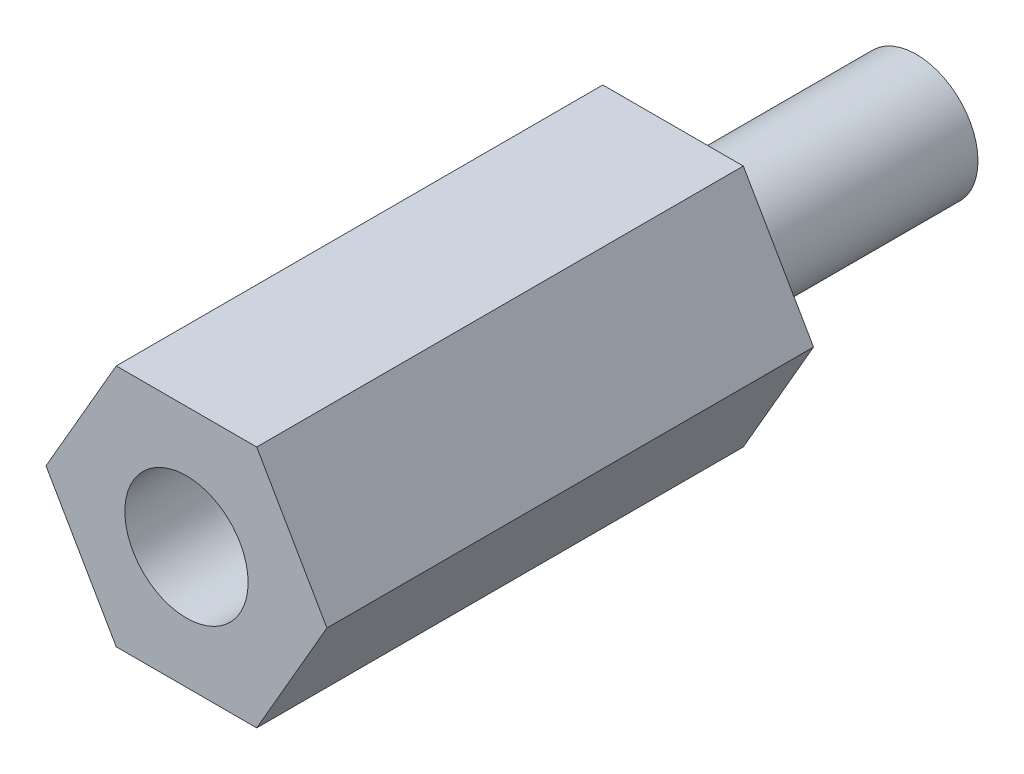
ISO-10303-21;
HEADER;
FILE_DESCRIPTION(('STEP AP214'),'2;1');
FILE_NAME('part.step','',(''),(''),'','','');
FILE_SCHEMA(('AUTOMOTIVE_DESIGN { 1 0 10303 214 1 1 1 1 }'));
ENDSEC;
DATA;
#1=APPLICATION_CONTEXT('core data for automotive mechanical design processes');
#2=APPLICATION_PROTOCOL_DEFINITION('international standard','automotive_design',2000,#1);
#3=PRODUCT_CONTEXT('',#1,'mechanical');
#4=PRODUCT('Part','Part','',(#3));
#5=PRODUCT_RELATED_PRODUCT_CATEGORY('part','',(#4));
#6=PRODUCT_DEFINITION_FORMATION('','',#4);
#7=PRODUCT_DEFINITION_CONTEXT('part definition',#1,'design');
#8=PRODUCT_DEFINITION('design','',#6,#7);
#9=PRODUCT_DEFINITION_SHAPE('','',#8);
#10=(LENGTH_UNIT() NAMED_UNIT(*) SI_UNIT(.MILLI.,.METRE.));
#11=(NAMED_UNIT(*) PLANE_ANGLE_UNIT() SI_UNIT($,.RADIAN.));
#12=(NAMED_UNIT(*) SI_UNIT($,.STERADIAN.) SOLID_ANGLE_UNIT());
#13=UNCERTAINTY_MEASURE_WITH_UNIT(LENGTH_MEASURE(1.E-05),#10,'distance_accuracy_value','');
#14=(GEOMETRIC_REPRESENTATION_CONTEXT(3) GLOBAL_UNCERTAINTY_ASSIGNED_CONTEXT((#13)) GLOBAL_UNIT_ASSIGNED_CONTEXT((#10,
#11,#12)) REPRESENTATION_CONTEXT('',''));
#15=CARTESIAN_POINT('',(0.,0.,0.));
#16=DIRECTION('',(0.,0.,1.));
#17=DIRECTION('',(1.,0.,0.));
#18=AXIS2_PLACEMENT_3D('',#15,#16,#17);
#19=CARTESIAN_POINT('',(-5.49926131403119,0.,19.05));
#20=DIRECTION('',(0.866025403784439,0.5,0.));
#21=DIRECTION('',(-0.5,0.866025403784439,0.));
#22=AXIS2_PLACEMENT_3D('',#19,#20,#21);
#23=PLANE('',#22);
#24=DIRECTION('',(0.5,-0.866025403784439,0.));
#25=VECTOR('',#24,1.);
#26=CARTESIAN_POINT('',(-5.49926131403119,0.,0.));
#27=LINE('',#26,#25);
#28=CARTESIAN_POINT('',(-5.49926131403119,0.,0.));
#29=VERTEX_POINT('',#28);
#30=CARTESIAN_POINT('',(-2.7496306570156,-4.7625,0.));
#31=VERTEX_POINT('',#30);
#32=EDGE_CURVE('E141',#29,#31,#27,.T.);
#33=ORIENTED_EDGE('',*,*,#32,.T.);
#34=DIRECTION('',(0.,0.,-1.));
#35=VECTOR('',#34,1.);
#36=CARTESIAN_POINT('',(-2.7496306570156,-4.7625,19.05));
#37=LINE('',#36,#35);
#38=CARTESIAN_POINT('',(-2.7496306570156,-4.7625,19.05));
#39=VERTEX_POINT('',#38);
#40=EDGE_CURVE('E47',#39,#31,#37,.T.);
#41=ORIENTED_EDGE('',*,*,#40,.F.);
#42=DIRECTION('',(0.5,-0.866025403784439,0.));
#43=VECTOR('',#42,1.);
#44=CARTESIAN_POINT('',(-5.49926131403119,0.,19.05));
#45=LINE('',#44,#43);
#46=CARTESIAN_POINT('',(-5.49926131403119,0.,19.05));
#47=VERTEX_POINT('',#46);
#48=EDGE_CURVE('E157',#47,#39,#45,.T.);
#49=ORIENTED_EDGE('',*,*,#48,.F.);
#50=DIRECTION('',(0.,0.,-1.));
#51=VECTOR('',#50,1.);
#52=CARTESIAN_POINT('',(-5.49926131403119,0.,19.05));
#53=LINE('',#52,#51);
#54=EDGE_CURVE('E137',#47,#29,#53,.T.);
#55=ORIENTED_EDGE('',*,*,#54,.T.);
#56=EDGE_LOOP('',(#33,#41,#49,#55));
#57=FACE_BOUND('',#56,.T.);
#58=ADVANCED_FACE('F38',(#57),#23,.F.);
#59=CARTESIAN_POINT('',(-2.7496306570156,-4.7625,19.05));
#60=DIRECTION('',(0.,1.,0.));
#61=DIRECTION('',(-1.,0.,0.));
#62=AXIS2_PLACEMENT_3D('',#59,#60,#61);
#63=PLANE('',#62);
#64=DIRECTION('',(1.,0.,0.));
#65=VECTOR('',#64,1.);
#66=CARTESIAN_POINT('',(-2.7496306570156,-4.7625,0.));
#67=LINE('',#66,#65);
#68=CARTESIAN_POINT('',(2.74963065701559,-4.7625,0.));
#69=VERTEX_POINT('',#68);
#70=EDGE_CURVE('E145',#31,#69,#67,.T.);
#71=ORIENTED_EDGE('',*,*,#70,.T.);
#72=DIRECTION('',(0.,0.,-1.));
#73=VECTOR('',#72,1.);
#74=CARTESIAN_POINT('',(2.74963065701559,-4.7625,19.05));
#75=LINE('',#74,#73);
#76=CARTESIAN_POINT('',(2.74963065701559,-4.7625,19.05));
#77=VERTEX_POINT('',#76);
#78=EDGE_CURVE('E164',#77,#69,#75,.T.);
#79=ORIENTED_EDGE('',*,*,#78,.F.);
#80=DIRECTION('',(1.,0.,0.));
#81=VECTOR('',#80,1.);
#82=CARTESIAN_POINT('',(-2.7496306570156,-4.7625,19.05));
#83=LINE('',#82,#81);
#84=EDGE_CURVE('E105',#39,#77,#83,.T.);
#85=ORIENTED_EDGE('',*,*,#84,.F.);
#86=ORIENTED_EDGE('',*,*,#40,.T.);
#87=EDGE_LOOP('',(#71,#79,#85,#86));
#88=FACE_BOUND('',#87,.T.);
#89=ADVANCED_FACE('F170',(#88),#63,.F.);
#90=CARTESIAN_POINT('',(2.74963065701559,-4.7625,19.05));
#91=DIRECTION('',(-0.866025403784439,0.5,0.));
#92=DIRECTION('',(-0.5,-0.866025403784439,0.));
#93=AXIS2_PLACEMENT_3D('',#90,#91,#92);
#94=PLANE('',#93);
#95=DIRECTION('',(0.5,0.866025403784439,0.));
#96=VECTOR('',#95,1.);
#97=CARTESIAN_POINT('',(2.74963065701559,-4.7625,0.));
#98=LINE('',#97,#96);
#99=CARTESIAN_POINT('',(5.49926131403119,0.,0.));
#100=VERTEX_POINT('',#99);
#101=EDGE_CURVE('E148',#69,#100,#98,.T.);
#102=ORIENTED_EDGE('',*,*,#101,.T.);
#103=DIRECTION('',(0.,0.,-1.));
#104=VECTOR('',#103,1.);
#105=CARTESIAN_POINT('',(5.49926131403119,0.,19.05));
#106=LINE('',#105,#104);
#107=CARTESIAN_POINT('',(5.49926131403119,0.,19.05));
#108=VERTEX_POINT('',#107);
#109=EDGE_CURVE('E129',#108,#100,#106,.T.);
#110=ORIENTED_EDGE('',*,*,#109,.F.);
#111=DIRECTION('',(0.5,0.866025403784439,0.));
#112=VECTOR('',#111,1.);
#113=CARTESIAN_POINT('',(2.74963065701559,-4.7625,19.05));
#114=LINE('',#113,#112);
#115=EDGE_CURVE('E118',#77,#108,#114,.T.);
#116=ORIENTED_EDGE('',*,*,#115,.F.);
#117=ORIENTED_EDGE('',*,*,#78,.T.);
#118=EDGE_LOOP('',(#102,#110,#116,#117));
#119=FACE_BOUND('',#118,.T.);
#120=ADVANCED_FACE('F178',(#119),#94,.F.);
#121=CARTESIAN_POINT('',(5.49926131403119,0.,19.05));
#122=DIRECTION('',(-0.866025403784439,-0.5,0.));
#123=DIRECTION('',(0.5,-0.866025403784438,0.));
#124=AXIS2_PLACEMENT_3D('',#121,#122,#123);
#125=PLANE('',#124);
#126=DIRECTION('',(-0.5,0.866025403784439,0.));
#127=VECTOR('',#126,1.);
#128=CARTESIAN_POINT('',(5.49926131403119,0.,0.));
#129=LINE('',#128,#127);
#130=CARTESIAN_POINT('',(2.74963065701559,4.7625,0.));
#131=VERTEX_POINT('',#130);
#132=EDGE_CURVE('E127',#100,#131,#129,.T.);
#133=ORIENTED_EDGE('',*,*,#132,.T.);
#134=DIRECTION('',(0.,0.,-1.));
#135=VECTOR('',#134,1.);
#136=CARTESIAN_POINT('',(2.74963065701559,4.7625,19.05));
#137=LINE('',#136,#135);
#138=CARTESIAN_POINT('',(2.74963065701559,4.7625,19.05));
#139=VERTEX_POINT('',#138);
#140=EDGE_CURVE('E124',#139,#131,#137,.T.);
#141=ORIENTED_EDGE('',*,*,#140,.F.);
#142=DIRECTION('',(-0.5,0.866025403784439,0.));
#143=VECTOR('',#142,1.);
#144=CARTESIAN_POINT('',(5.49926131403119,0.,19.05));
#145=LINE('',#144,#143);
#146=EDGE_CURVE('E112',#108,#139,#145,.T.);
#147=ORIENTED_EDGE('',*,*,#146,.F.);
#148=ORIENTED_EDGE('',*,*,#109,.T.);
#149=EDGE_LOOP('',(#133,#141,#147,#148));
#150=FACE_BOUND('',#149,.T.);
#151=ADVANCED_FACE('F125',(#150),#125,.F.);
#152=CARTESIAN_POINT('',(2.74963065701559,4.7625,19.05));
#153=DIRECTION('',(0.,-1.,0.));
#154=DIRECTION('',(1.,0.,0.));
#155=AXIS2_PLACEMENT_3D('',#152,#153,#154);
#156=PLANE('',#155);
#157=DIRECTION('',(-1.,0.,0.));
#158=VECTOR('',#157,1.);
#159=CARTESIAN_POINT('',(2.74963065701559,4.7625,0.));
#160=LINE('',#159,#158);
#161=CARTESIAN_POINT('',(-2.74963065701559,4.76250000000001,0.));
#162=VERTEX_POINT('',#161);
#163=EDGE_CURVE('E88',#131,#162,#160,.T.);
#164=ORIENTED_EDGE('',*,*,#163,.T.);
#165=DIRECTION('',(0.,0.,-1.));
#166=VECTOR('',#165,1.);
#167=CARTESIAN_POINT('',(-2.74963065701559,4.76250000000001,19.05));
#168=LINE('',#167,#166);
#169=CARTESIAN_POINT('',(-2.74963065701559,4.76250000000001,19.05));
#170=VERTEX_POINT('',#169);
#171=EDGE_CURVE('E130',#170,#162,#168,.T.);
#172=ORIENTED_EDGE('',*,*,#171,.F.);
#173=DIRECTION('',(-1.,0.,0.));
#174=VECTOR('',#173,1.);
#175=CARTESIAN_POINT('',(2.74963065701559,4.7625,19.05));
#176=LINE('',#175,#174);
#177=EDGE_CURVE('E116',#139,#170,#176,.T.);
#178=ORIENTED_EDGE('',*,*,#177,.F.);
#179=ORIENTED_EDGE('',*,*,#140,.T.);
#180=EDGE_LOOP('',(#164,#172,#178,#179));
#181=FACE_BOUND('',#180,.T.);
#182=ADVANCED_FACE('F132',(#181),#156,.F.);
#183=CARTESIAN_POINT('',(-2.74963065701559,4.76250000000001,19.05));
#184=DIRECTION('',(0.866025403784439,-0.5,0.));
#185=DIRECTION('',(0.5,0.866025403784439,0.));
#186=AXIS2_PLACEMENT_3D('',#183,#184,#185);
#187=PLANE('',#186);
#188=DIRECTION('',(-0.5,-0.866025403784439,0.));
#189=VECTOR('',#188,1.);
#190=CARTESIAN_POINT('',(-2.74963065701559,4.76250000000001,0.));
#191=LINE('',#190,#189);
#192=EDGE_CURVE('E94',#162,#29,#191,.T.);
#193=ORIENTED_EDGE('',*,*,#192,.T.);
#194=ORIENTED_EDGE('',*,*,#54,.F.);
#195=DIRECTION('',(-0.5,-0.866025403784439,0.));
#196=VECTOR('',#195,1.);
#197=CARTESIAN_POINT('',(-2.74963065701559,4.76250000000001,19.05));
#198=LINE('',#197,#196);
#199=EDGE_CURVE('E58',#170,#47,#198,.T.);
#200=ORIENTED_EDGE('',*,*,#199,.F.);
#201=ORIENTED_EDGE('',*,*,#171,.T.);
#202=EDGE_LOOP('',(#193,#194,#200,#201));
#203=FACE_BOUND('',#202,.T.);
#204=ADVANCED_FACE('F206',(#203),#187,.F.);
#205=CARTESIAN_POINT('',(0.,0.,19.05));
#206=DIRECTION('',(0.,0.,1.));
#207=DIRECTION('',(1.,0.,0.));
#208=AXIS2_PLACEMENT_3D('',#205,#206,#207);
#209=PLANE('',#208);
#210=CARTESIAN_POINT('',(0.,0.,19.05));
#211=DIRECTION('',(0.,0.,1.));
#212=DIRECTION('',(1.,0.,0.));
#213=AXIS2_PLACEMENT_3D('',#210,#211,#212);
#214=CIRCLE('',#213,2.413);
#215=CARTESIAN_POINT('',(2.413,0.,19.05));
#216=VERTEX_POINT('',#215);
#217=EDGE_CURVE('E189',#216,#216,#214,.T.);
#218=ORIENTED_EDGE('',*,*,#217,.F.);
#219=EDGE_LOOP('',(#218));
#220=FACE_BOUND('',#219,.T.);
#221=ORIENTED_EDGE('',*,*,#48,.T.);
#222=ORIENTED_EDGE('',*,*,#84,.T.);
#223=ORIENTED_EDGE('',*,*,#115,.T.);
#224=ORIENTED_EDGE('',*,*,#146,.T.);
#225=ORIENTED_EDGE('',*,*,#177,.T.);
#226=ORIENTED_EDGE('',*,*,#199,.T.);
#227=EDGE_LOOP('',(#221,#222,#223,#224,#225,#226));
#228=FACE_BOUND('',#227,.T.);
#229=ADVANCED_FACE('F114',(#220,#228),#209,.T.);
#230=CARTESIAN_POINT('',(0.,0.,0.));
#231=DIRECTION('',(0.,0.,1.));
#232=DIRECTION('',(1.,0.,0.));
#233=AXIS2_PLACEMENT_3D('',#230,#231,#232);
#234=PLANE('',#233);
#235=CARTESIAN_POINT('',(0.,0.,0.));
#236=DIRECTION('',(0.,0.,1.));
#237=DIRECTION('',(1.,0.,0.));
#238=AXIS2_PLACEMENT_3D('',#235,#236,#237);
#239=CIRCLE('',#238,2.413);
#240=CARTESIAN_POINT('',(2.413,0.,0.));
#241=VERTEX_POINT('',#240);
#242=EDGE_CURVE('E11',#241,#241,#239,.F.);
#243=ORIENTED_EDGE('',*,*,#242,.F.);
#244=EDGE_LOOP('',(#243));
#245=FACE_BOUND('',#244,.T.);
#246=ORIENTED_EDGE('',*,*,#32,.F.);
#247=ORIENTED_EDGE('',*,*,#192,.F.);
#248=ORIENTED_EDGE('',*,*,#163,.F.);
#249=ORIENTED_EDGE('',*,*,#132,.F.);
#250=ORIENTED_EDGE('',*,*,#101,.F.);
#251=ORIENTED_EDGE('',*,*,#70,.F.);
#252=EDGE_LOOP('',(#246,#247,#248,#249,#250,#251));
#253=FACE_BOUND('',#252,.T.);
#254=ADVANCED_FACE('F175',(#245,#253),#234,.F.);
#255=CARTESIAN_POINT('',(0.,0.,-9.525));
#256=DIRECTION('',(0.,0.,1.));
#257=DIRECTION('',(1.,0.,0.));
#258=AXIS2_PLACEMENT_3D('',#255,#256,#257);
#259=CYLINDRICAL_SURFACE('',#258,2.413);
#260=CARTESIAN_POINT('',(0.,0.,-9.525));
#261=DIRECTION('',(0.,0.,-1.));
#262=DIRECTION('',(-1.,0.,0.));
#263=AXIS2_PLACEMENT_3D('',#260,#261,#262);
#264=CIRCLE('',#263,2.413);
#265=CARTESIAN_POINT('',(2.413,0.,-9.525));
#266=VERTEX_POINT('',#265);
#267=EDGE_CURVE('E146',#266,#266,#264,.T.);
#268=CARTESIAN_POINT('',(2.413,0.,-9.525));
#269=CARTESIAN_POINT('',(2.413,0.,-9.42578125));
#270=CARTESIAN_POINT('',(2.413,0.,-9.3265625));
#271=CARTESIAN_POINT('',(2.413,0.,-9.128125));
#272=CARTESIAN_POINT('',(2.413,0.,-9.02890625));
#273=CARTESIAN_POINT('',(2.413,0.,-8.83046875));
#274=CARTESIAN_POINT('',(2.413,0.,-8.73125));
#275=CARTESIAN_POINT('',(2.413,0.,-8.5328125));
#276=CARTESIAN_POINT('',(2.413,0.,-8.43359375));
#277=CARTESIAN_POINT('',(2.413,0.,-8.23515625));
#278=CARTESIAN_POINT('',(2.413,0.,-8.1359375));
#279=CARTESIAN_POINT('',(2.413,0.,-7.9375));
#280=CARTESIAN_POINT('',(2.413,0.,-7.83828125));
#281=CARTESIAN_POINT('',(2.413,0.,-7.63984375));
#282=CARTESIAN_POINT('',(2.413,0.,-7.540625));
#283=CARTESIAN_POINT('',(2.413,0.,-7.3421875));
#284=CARTESIAN_POINT('',(2.413,0.,-7.24296875));
#285=CARTESIAN_POINT('',(2.413,0.,-7.04453125));
#286=CARTESIAN_POINT('',(2.413,0.,-6.9453125));
#287=CARTESIAN_POINT('',(2.413,0.,-6.746875));
#288=CARTESIAN_POINT('',(2.413,0.,-6.64765625));
#289=CARTESIAN_POINT('',(2.413,0.,-6.44921875));
#290=CARTESIAN_POINT('',(2.413,0.,-6.35));
#291=CARTESIAN_POINT('',(2.413,0.,-6.1515625));
#292=CARTESIAN_POINT('',(2.413,0.,-6.05234375));
#293=CARTESIAN_POINT('',(2.413,0.,-5.85390625));
#294=CARTESIAN_POINT('',(2.413,0.,-5.7546875));
#295=CARTESIAN_POINT('',(2.413,0.,-5.55625));
#296=CARTESIAN_POINT('',(2.413,0.,-5.45703125));
#297=CARTESIAN_POINT('',(2.413,0.,-5.25859375));
#298=CARTESIAN_POINT('',(2.413,0.,-5.159375));
#299=CARTESIAN_POINT('',(2.413,0.,-4.9609375));
#300=CARTESIAN_POINT('',(2.413,0.,-4.86171875));
#301=CARTESIAN_POINT('',(2.413,0.,-4.66328125));
#302=CARTESIAN_POINT('',(2.413,0.,-4.5640625));
#303=CARTESIAN_POINT('',(2.413,0.,-4.365625));
#304=CARTESIAN_POINT('',(2.413,0.,-4.26640625));
#305=CARTESIAN_POINT('',(2.413,0.,-4.06796875));
#306=CARTESIAN_POINT('',(2.413,0.,-3.96875));
#307=CARTESIAN_POINT('',(2.413,0.,-3.7703125));
#308=CARTESIAN_POINT('',(2.413,0.,-3.67109375));
#309=CARTESIAN_POINT('',(2.413,0.,-3.47265625));
#310=CARTESIAN_POINT('',(2.413,0.,-3.3734375));
#311=CARTESIAN_POINT('',(2.413,0.,-3.175));
#312=CARTESIAN_POINT('',(2.413,0.,-3.07578125));
#313=CARTESIAN_POINT('',(2.413,0.,-2.87734375));
#314=CARTESIAN_POINT('',(2.413,0.,-2.778125));
#315=CARTESIAN_POINT('',(2.413,0.,-2.5796875));
#316=CARTESIAN_POINT('',(2.413,0.,-2.48046875));
#317=CARTESIAN_POINT('',(2.413,0.,-2.28203125));
#318=CARTESIAN_POINT('',(2.413,0.,-2.1828125));
#319=CARTESIAN_POINT('',(2.413,0.,-1.984375));
#320=CARTESIAN_POINT('',(2.413,0.,-1.88515625));
#321=CARTESIAN_POINT('',(2.413,0.,-1.68671875));
#322=CARTESIAN_POINT('',(2.413,0.,-1.5875));
#323=CARTESIAN_POINT('',(2.413,0.,-1.3890625));
#324=CARTESIAN_POINT('',(2.413,0.,-1.28984375));
#325=CARTESIAN_POINT('',(2.413,0.,-1.09140625));
#326=CARTESIAN_POINT('',(2.413,0.,-0.992187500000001));
#327=CARTESIAN_POINT('',(2.413,0.,-0.793750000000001));
#328=CARTESIAN_POINT('',(2.413,0.,-0.69453125));
#329=CARTESIAN_POINT('',(2.413,0.,-0.49609375));
#330=CARTESIAN_POINT('',(2.413,0.,-0.396875));
#331=CARTESIAN_POINT('',(2.413,0.,-0.1984375));
#332=CARTESIAN_POINT('',(2.413,0.,-0.0992187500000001));
#333=CARTESIAN_POINT('',(2.413,0.,0.));
#334=B_SPLINE_CURVE_WITH_KNOTS('',3,(#268,#269,#270,#271,#272,#273,#274,#275,#276,#277,#278,
#279,#280,#281,#282,#283,#284,#285,#286,#287,#288,#289,#290,#291,#292,#293,#294,#295,#296,#297,
#298,#299,#300,#301,#302,#303,#304,#305,#306,#307,#308,#309,#310,#311,#312,#313,#314,#315,#316,
#317,#318,#319,#320,#321,#322,#323,#324,#325,#326,#327,#328,#329,#330,#331,#332,#333),
.UNSPECIFIED.,.F.,.F.,(4,2,2,2,2,2,2,2,2,2,2,2,2,2,2,2,2,2,2,2,2,2,2,2,2,2,2,2,2,2,2,2,4),(0.,
0.29765625,0.5953125,0.892968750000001,1.190625,1.48828125,1.7859375,2.08359375,2.38125,
2.67890625,2.9765625,3.27421875,3.571875,3.86953125,4.1671875,4.46484375,4.7625,5.06015625,
5.3578125,5.65546875,5.953125,6.25078125,6.5484375,6.84609375,7.14375,7.44140625,7.7390625,
8.03671875,8.334375,8.63203125,8.9296875,9.22734375,9.525),.UNSPECIFIED.);
#335=EDGE_CURVE('BSEAM212',#266,#241,#334,.T.);
#336=ORIENTED_EDGE('',*,*,#267,.F.);
#337=ORIENTED_EDGE('',*,*,#242,.T.);
#338=ORIENTED_EDGE('',*,*,#335,.T.);
#339=ORIENTED_EDGE('',*,*,#335,.F.);
#340=EDGE_LOOP('',(#336,#338,#337,#339));
#341=FACE_BOUND('',#340,.T.);
#342=ADVANCED_FACE('F212',(#341),#259,.T.);
#343=CARTESIAN_POINT('',(0.,0.,-9.525));
#344=DIRECTION('',(0.,0.,-1.));
#345=DIRECTION('',(-1.,0.,0.));
#346=AXIS2_PLACEMENT_3D('',#343,#344,#345);
#347=PLANE('',#346);
#348=ORIENTED_EDGE('',*,*,#267,.T.);
#349=EDGE_LOOP('',(#348));
#350=FACE_BOUND('',#349,.T.);
#351=ADVANCED_FACE('F201',(#350),#347,.T.);
#352=CARTESIAN_POINT('',(0.,0.,9.525));
#353=DIRECTION('',(0.,0.,1.));
#354=DIRECTION('',(1.,0.,0.));
#355=AXIS2_PLACEMENT_3D('',#352,#353,#354);
#356=CYLINDRICAL_SURFACE('',#355,2.413);
#357=CARTESIAN_POINT('',(0.,0.,9.525));
#358=DIRECTION('',(0.,0.,1.));
#359=DIRECTION('',(1.,0.,0.));
#360=AXIS2_PLACEMENT_3D('',#357,#358,#359);
#361=CIRCLE('',#360,2.413);
#362=CARTESIAN_POINT('',(2.413,0.,9.525));
#363=VERTEX_POINT('',#362);
#364=EDGE_CURVE('E188',#363,#363,#361,.T.);
#365=CARTESIAN_POINT('',(2.413,0.,9.525));
#366=CARTESIAN_POINT('',(2.413,0.,9.62421875));
#367=CARTESIAN_POINT('',(2.413,0.,9.7234375));
#368=CARTESIAN_POINT('',(2.413,0.,9.921875));
#369=CARTESIAN_POINT('',(2.413,0.,10.02109375));
#370=CARTESIAN_POINT('',(2.413,0.,10.21953125));
#371=CARTESIAN_POINT('',(2.413,0.,10.31875));
#372=CARTESIAN_POINT('',(2.413,0.,10.5171875));
#373=CARTESIAN_POINT('',(2.413,0.,10.61640625));
#374=CARTESIAN_POINT('',(2.413,0.,10.81484375));
#375=CARTESIAN_POINT('',(2.413,0.,10.9140625));
#376=CARTESIAN_POINT('',(2.413,0.,11.1125));
#377=CARTESIAN_POINT('',(2.413,0.,11.21171875));
#378=CARTESIAN_POINT('',(2.413,0.,11.41015625));
#379=CARTESIAN_POINT('',(2.413,0.,11.509375));
#380=CARTESIAN_POINT('',(2.413,0.,11.7078125));
#381=CARTESIAN_POINT('',(2.413,0.,11.80703125));
#382=CARTESIAN_POINT('',(2.413,0.,12.00546875));
#383=CARTESIAN_POINT('',(2.413,0.,12.1046875));
#384=CARTESIAN_POINT('',(2.413,0.,12.303125));
#385=CARTESIAN_POINT('',(2.413,0.,12.40234375));
#386=CARTESIAN_POINT('',(2.413,0.,12.60078125));
#387=CARTESIAN_POINT('',(2.413,0.,12.7));
#388=CARTESIAN_POINT('',(2.413,0.,12.8984375));
#389=CARTESIAN_POINT('',(2.413,0.,12.99765625));
#390=CARTESIAN_POINT('',(2.413,0.,13.19609375));
#391=CARTESIAN_POINT('',(2.413,0.,13.2953125));
#392=CARTESIAN_POINT('',(2.413,0.,13.49375));
#393=CARTESIAN_POINT('',(2.413,0.,13.59296875));
#394=CARTESIAN_POINT('',(2.413,0.,13.79140625));
#395=CARTESIAN_POINT('',(2.413,0.,13.890625));
#396=CARTESIAN_POINT('',(2.413,0.,14.0890625));
#397=CARTESIAN_POINT('',(2.413,0.,14.18828125));
#398=CARTESIAN_POINT('',(2.413,0.,14.38671875));
#399=CARTESIAN_POINT('',(2.413,0.,14.4859375));
#400=CARTESIAN_POINT('',(2.413,0.,14.684375));
#401=CARTESIAN_POINT('',(2.413,0.,14.78359375));
#402=CARTESIAN_POINT('',(2.413,0.,14.98203125));
#403=CARTESIAN_POINT('',(2.413,0.,15.08125));
#404=CARTESIAN_POINT('',(2.413,0.,15.2796875));
#405=CARTESIAN_POINT('',(2.413,0.,15.37890625));
#406=CARTESIAN_POINT('',(2.413,0.,15.57734375));
#407=CARTESIAN_POINT('',(2.413,0.,15.6765625));
#408=CARTESIAN_POINT('',(2.413,0.,15.875));
#409=CARTESIAN_POINT('',(2.413,0.,15.97421875));
#410=CARTESIAN_POINT('',(2.413,0.,16.17265625));
#411=CARTESIAN_POINT('',(2.413,0.,16.271875));
#412=CARTESIAN_POINT('',(2.413,0.,16.4703125));
#413=CARTESIAN_POINT('',(2.413,0.,16.56953125));
#414=CARTESIAN_POINT('',(2.413,0.,16.76796875));
#415=CARTESIAN_POINT('',(2.413,0.,16.8671875));
#416=CARTESIAN_POINT('',(2.413,0.,17.065625));
#417=CARTESIAN_POINT('',(2.413,0.,17.16484375));
#418=CARTESIAN_POINT('',(2.413,0.,17.36328125));
#419=CARTESIAN_POINT('',(2.413,0.,17.4625));
#420=CARTESIAN_POINT('',(2.413,0.,17.6609375));
#421=CARTESIAN_POINT('',(2.413,0.,17.76015625));
#422=CARTESIAN_POINT('',(2.413,0.,17.95859375));
#423=CARTESIAN_POINT('',(2.413,0.,18.0578125));
#424=CARTESIAN_POINT('',(2.413,0.,18.25625));
#425=CARTESIAN_POINT('',(2.413,0.,18.35546875));
#426=CARTESIAN_POINT('',(2.413,0.,18.55390625));
#427=CARTESIAN_POINT('',(2.413,0.,18.653125));
#428=CARTESIAN_POINT('',(2.413,0.,18.8515625));
#429=CARTESIAN_POINT('',(2.413,0.,18.95078125));
#430=CARTESIAN_POINT('',(2.413,0.,19.05));
#431=B_SPLINE_CURVE_WITH_KNOTS('',3,(#365,#366,#367,#368,#369,#370,#371,#372,#373,#374,#375,
#376,#377,#378,#379,#380,#381,#382,#383,#384,#385,#386,#387,#388,#389,#390,#391,#392,#393,#394,
#395,#396,#397,#398,#399,#400,#401,#402,#403,#404,#405,#406,#407,#408,#409,#410,#411,#412,#413,
#414,#415,#416,#417,#418,#419,#420,#421,#422,#423,#424,#425,#426,#427,#428,#429,#430),
.UNSPECIFIED.,.F.,.F.,(4,2,2,2,2,2,2,2,2,2,2,2,2,2,2,2,2,2,2,2,2,2,2,2,2,2,2,2,2,2,2,2,4),(0.,
0.297656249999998,0.595312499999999,0.892968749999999,1.190625,1.48828125,1.7859375,2.08359375,
2.38125,2.67890625,2.9765625,3.27421875,3.571875,3.86953125,4.1671875,4.46484375,4.7625,
5.06015625,5.3578125,5.65546875,5.953125,6.25078125,6.5484375,6.84609375,7.14375,7.44140625,
7.7390625,8.03671875,8.334375,8.63203125,8.9296875,9.22734375,9.525),.UNSPECIFIED.);
#432=EDGE_CURVE('BSEAM198',#363,#216,#431,.T.);
#433=ORIENTED_EDGE('',*,*,#364,.F.);
#434=ORIENTED_EDGE('',*,*,#217,.T.);
#435=ORIENTED_EDGE('',*,*,#432,.T.);
#436=ORIENTED_EDGE('',*,*,#432,.F.);
#437=EDGE_LOOP('',(#433,#435,#434,#436));
#438=FACE_BOUND('',#437,.T.);
#439=ADVANCED_FACE('F198',(#438),#356,.F.);
#440=CARTESIAN_POINT('',(0.,0.,9.525));
#441=DIRECTION('',(0.,0.,1.));
#442=DIRECTION('',(1.,0.,0.));
#443=AXIS2_PLACEMENT_3D('',#440,#441,#442);
#444=PLANE('',#443);
#445=ORIENTED_EDGE('',*,*,#364,.T.);
#446=EDGE_LOOP('',(#445));
#447=FACE_BOUND('',#446,.T.);
#448=ADVANCED_FACE('F196',(#447),#444,.T.);
#449=CLOSED_SHELL('',(#58,#89,#120,#151,#182,#204,#229,#254,#342,#351,#439,#448));
#450=MANIFOLD_SOLID_BREP('B2',#449);
#451=ADVANCED_BREP_SHAPE_REPRESENTATION('',(#18,#450),#14);
#452=SHAPE_DEFINITION_REPRESENTATION(#9,#451);
ENDSEC;
END-ISO-10303-21;
